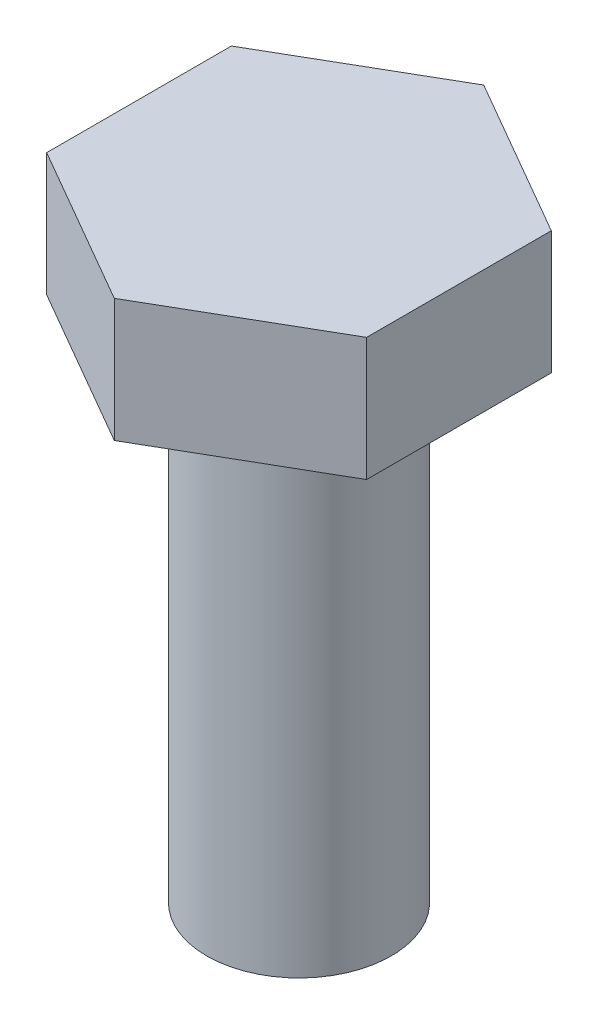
ISO-10303-21;
HEADER;
FILE_DESCRIPTION(('STEP AP214'),'2;1');
FILE_NAME('part.step','',(''),(''),'','','');
FILE_SCHEMA(('AUTOMOTIVE_DESIGN { 1 0 10303 214 1 1 1 1 }'));
ENDSEC;
DATA;
#1=APPLICATION_CONTEXT('core data for automotive mechanical design processes');
#2=APPLICATION_PROTOCOL_DEFINITION('international standard','automotive_design',2000,#1);
#3=PRODUCT_CONTEXT('',#1,'mechanical');
#4=PRODUCT('Part','Part','',(#3));
#5=PRODUCT_RELATED_PRODUCT_CATEGORY('part','',(#4));
#6=PRODUCT_DEFINITION_FORMATION('','',#4);
#7=PRODUCT_DEFINITION_CONTEXT('part definition',#1,'design');
#8=PRODUCT_DEFINITION('design','',#6,#7);
#9=PRODUCT_DEFINITION_SHAPE('','',#8);
#10=(LENGTH_UNIT() NAMED_UNIT(*) SI_UNIT(.MILLI.,.METRE.));
#11=(NAMED_UNIT(*) PLANE_ANGLE_UNIT() SI_UNIT($,.RADIAN.));
#12=(NAMED_UNIT(*) SI_UNIT($,.STERADIAN.) SOLID_ANGLE_UNIT());
#13=UNCERTAINTY_MEASURE_WITH_UNIT(LENGTH_MEASURE(1.E-05),#10,'distance_accuracy_value','');
#14=(GEOMETRIC_REPRESENTATION_CONTEXT(3) GLOBAL_UNCERTAINTY_ASSIGNED_CONTEXT((#13)) GLOBAL_UNIT_ASSIGNED_CONTEXT((#10,
#11,#12)) REPRESENTATION_CONTEXT('',''));
#15=CARTESIAN_POINT('',(0.,0.,0.));
#16=DIRECTION('',(0.,0.,1.));
#17=DIRECTION('',(1.,0.,0.));
#18=AXIS2_PLACEMENT_3D('',#15,#16,#17);
#19=CARTESIAN_POINT('',(0.,40.,0.));
#20=DIRECTION('',(0.,-1.,0.));
#21=DIRECTION('',(0.,0.,-1.));
#22=AXIS2_PLACEMENT_3D('',#19,#20,#21);
#23=CYLINDRICAL_SURFACE('',#22,7.5);
#24=CARTESIAN_POINT('',(0.,40.,0.));
#25=DIRECTION('',(0.,1.,0.));
#26=DIRECTION('',(0.,0.,1.));
#27=AXIS2_PLACEMENT_3D('',#24,#25,#26);
#28=CIRCLE('',#27,7.5);
#29=CARTESIAN_POINT('',(0.,40.,7.5));
#30=VERTEX_POINT('',#29);
#31=EDGE_CURVE('E11',#30,#30,#28,.T.);
#32=ORIENTED_EDGE('',*,*,#31,.F.);
#33=EDGE_LOOP('',(#32));
#34=FACE_BOUND('',#33,.T.);
#35=CARTESIAN_POINT('',(0.,0.,0.));
#36=DIRECTION('',(0.,1.,0.));
#37=DIRECTION('',(0.,0.,1.));
#38=AXIS2_PLACEMENT_3D('',#35,#36,#37);
#39=CIRCLE('',#38,7.5);
#40=CARTESIAN_POINT('',(0.,0.,7.5));
#41=VERTEX_POINT('',#40);
#42=EDGE_CURVE('E34',#41,#41,#39,.T.);
#43=ORIENTED_EDGE('',*,*,#42,.T.);
#44=EDGE_LOOP('',(#43));
#45=FACE_BOUND('',#44,.T.);
#46=ADVANCED_FACE('F31',(#34,#45),#23,.T.);
#47=CARTESIAN_POINT('',(0.,0.,0.));
#48=DIRECTION('',(0.,1.,0.));
#49=DIRECTION('',(0.,0.,1.));
#50=AXIS2_PLACEMENT_3D('',#47,#48,#49);
#51=PLANE('',#50);
#52=ORIENTED_EDGE('',*,*,#42,.F.);
#53=EDGE_LOOP('',(#52));
#54=FACE_BOUND('',#53,.T.);
#55=ADVANCED_FACE('F139',(#54),#51,.F.);
#56=CARTESIAN_POINT('',(12.9903810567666,40.,-7.5));
#57=DIRECTION('',(0.,1.,0.));
#58=DIRECTION('',(0.,0.,1.));
#59=AXIS2_PLACEMENT_3D('',#56,#57,#58);
#60=PLANE('',#59);
#61=DIRECTION('',(0.,0.,-1.));
#62=VECTOR('',#61,1.);
#63=CARTESIAN_POINT('',(12.9903810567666,40.,7.5));
#64=LINE('',#63,#62);
#65=CARTESIAN_POINT('',(12.9903810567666,40.,7.5));
#66=VERTEX_POINT('',#65);
#67=CARTESIAN_POINT('',(12.9903810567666,40.,-7.5));
#68=VERTEX_POINT('',#67);
#69=EDGE_CURVE('E116',#66,#68,#64,.T.);
#70=ORIENTED_EDGE('',*,*,#69,.F.);
#71=DIRECTION('',(0.866025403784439,0.,-0.5));
#72=VECTOR('',#71,1.);
#73=CARTESIAN_POINT('',(0.,40.,15.));
#74=LINE('',#73,#72);
#75=CARTESIAN_POINT('',(0.,40.,15.));
#76=VERTEX_POINT('',#75);
#77=EDGE_CURVE('E76',#76,#66,#74,.T.);
#78=ORIENTED_EDGE('',*,*,#77,.F.);
#79=DIRECTION('',(0.866025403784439,0.,0.5));
#80=VECTOR('',#79,1.);
#81=CARTESIAN_POINT('',(-12.9903810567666,40.,7.5));
#82=LINE('',#81,#80);
#83=CARTESIAN_POINT('',(-12.9903810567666,40.,7.5));
#84=VERTEX_POINT('',#83);
#85=EDGE_CURVE('E70',#84,#76,#82,.T.);
#86=ORIENTED_EDGE('',*,*,#85,.F.);
#87=DIRECTION('',(0.,0.,1.));
#88=VECTOR('',#87,1.);
#89=CARTESIAN_POINT('',(-12.9903810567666,40.,-7.50000000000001));
#90=LINE('',#89,#88);
#91=CARTESIAN_POINT('',(-12.9903810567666,40.,-7.50000000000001));
#92=VERTEX_POINT('',#91);
#93=EDGE_CURVE('E106',#92,#84,#90,.T.);
#94=ORIENTED_EDGE('',*,*,#93,.F.);
#95=DIRECTION('',(-0.866025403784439,0.,0.5));
#96=VECTOR('',#95,1.);
#97=CARTESIAN_POINT('',(0.,40.,-15.));
#98=LINE('',#97,#96);
#99=CARTESIAN_POINT('',(0.,40.,-15.));
#100=VERTEX_POINT('',#99);
#101=EDGE_CURVE('E121',#100,#92,#98,.T.);
#102=ORIENTED_EDGE('',*,*,#101,.F.);
#103=DIRECTION('',(-0.866025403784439,0.,-0.5));
#104=VECTOR('',#103,1.);
#105=CARTESIAN_POINT('',(12.9903810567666,40.,-7.5));
#106=LINE('',#105,#104);
#107=EDGE_CURVE('E119',#68,#100,#106,.T.);
#108=ORIENTED_EDGE('',*,*,#107,.F.);
#109=EDGE_LOOP('',(#70,#78,#86,#94,#102,#108));
#110=FACE_BOUND('',#109,.T.);
#111=ORIENTED_EDGE('',*,*,#31,.T.);
#112=EDGE_LOOP('',(#111));
#113=FACE_BOUND('',#112,.T.);
#114=ADVANCED_FACE('F141',(#110,#113),#60,.F.);
#115=CARTESIAN_POINT('',(12.9903810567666,50.,7.5));
#116=DIRECTION('',(-1.,0.,0.));
#117=DIRECTION('',(0.,0.,1.));
#118=AXIS2_PLACEMENT_3D('',#115,#116,#117);
#119=PLANE('',#118);
#120=ORIENTED_EDGE('',*,*,#69,.T.);
#121=DIRECTION('',(0.,-1.,0.));
#122=VECTOR('',#121,1.);
#123=CARTESIAN_POINT('',(12.9903810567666,50.,-7.5));
#124=LINE('',#123,#122);
#125=CARTESIAN_POINT('',(12.9903810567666,50.,-7.5));
#126=VERTEX_POINT('',#125);
#127=EDGE_CURVE('E133',#126,#68,#124,.T.);
#128=ORIENTED_EDGE('',*,*,#127,.F.);
#129=DIRECTION('',(0.,0.,-1.));
#130=VECTOR('',#129,1.);
#131=CARTESIAN_POINT('',(12.9903810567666,50.,7.5));
#132=LINE('',#131,#130);
#133=CARTESIAN_POINT('',(12.9903810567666,50.,7.5));
#134=VERTEX_POINT('',#133);
#135=EDGE_CURVE('E126',#134,#126,#132,.T.);
#136=ORIENTED_EDGE('',*,*,#135,.F.);
#137=DIRECTION('',(0.,-1.,0.));
#138=VECTOR('',#137,1.);
#139=CARTESIAN_POINT('',(12.9903810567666,50.,7.5));
#140=LINE('',#139,#138);
#141=EDGE_CURVE('E112',#134,#66,#140,.T.);
#142=ORIENTED_EDGE('',*,*,#141,.T.);
#143=EDGE_LOOP('',(#120,#128,#136,#142));
#144=FACE_BOUND('',#143,.T.);
#145=ADVANCED_FACE('F146',(#144),#119,.F.);
#146=CARTESIAN_POINT('',(12.9903810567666,50.,-7.5));
#147=DIRECTION('',(-0.5,0.,0.866025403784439));
#148=DIRECTION('',(0.866025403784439,0.,0.5));
#149=AXIS2_PLACEMENT_3D('',#146,#147,#148);
#150=PLANE('',#149);
#151=ORIENTED_EDGE('',*,*,#107,.T.);
#152=DIRECTION('',(0.,-1.,0.));
#153=VECTOR('',#152,1.);
#154=CARTESIAN_POINT('',(0.,50.,-15.));
#155=LINE('',#154,#153);
#156=CARTESIAN_POINT('',(0.,50.,-15.));
#157=VERTEX_POINT('',#156);
#158=EDGE_CURVE('E130',#157,#100,#155,.T.);
#159=ORIENTED_EDGE('',*,*,#158,.F.);
#160=DIRECTION('',(-0.866025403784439,0.,-0.5));
#161=VECTOR('',#160,1.);
#162=CARTESIAN_POINT('',(12.9903810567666,50.,-7.5));
#163=LINE('',#162,#161);
#164=EDGE_CURVE('E85',#126,#157,#163,.T.);
#165=ORIENTED_EDGE('',*,*,#164,.F.);
#166=ORIENTED_EDGE('',*,*,#127,.T.);
#167=EDGE_LOOP('',(#151,#159,#165,#166));
#168=FACE_BOUND('',#167,.T.);
#169=ADVANCED_FACE('F153',(#168),#150,.F.);
#170=CARTESIAN_POINT('',(0.,50.,-15.));
#171=DIRECTION('',(0.5,0.,0.866025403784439));
#172=DIRECTION('',(0.866025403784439,0.,-0.5));
#173=AXIS2_PLACEMENT_3D('',#170,#171,#172);
#174=PLANE('',#173);
#175=ORIENTED_EDGE('',*,*,#101,.T.);
#176=DIRECTION('',(0.,-1.,0.));
#177=VECTOR('',#176,1.);
#178=CARTESIAN_POINT('',(-12.9903810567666,50.,-7.50000000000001));
#179=LINE('',#178,#177);
#180=CARTESIAN_POINT('',(-12.9903810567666,50.,-7.50000000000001));
#181=VERTEX_POINT('',#180);
#182=EDGE_CURVE('E107',#181,#92,#179,.T.);
#183=ORIENTED_EDGE('',*,*,#182,.F.);
#184=DIRECTION('',(-0.866025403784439,0.,0.5));
#185=VECTOR('',#184,1.);
#186=CARTESIAN_POINT('',(0.,50.,-15.));
#187=LINE('',#186,#185);
#188=EDGE_CURVE('E98',#157,#181,#187,.T.);
#189=ORIENTED_EDGE('',*,*,#188,.F.);
#190=ORIENTED_EDGE('',*,*,#158,.T.);
#191=EDGE_LOOP('',(#175,#183,#189,#190));
#192=FACE_BOUND('',#191,.T.);
#193=ADVANCED_FACE('F157',(#192),#174,.F.);
#194=CARTESIAN_POINT('',(-12.9903810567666,50.,-7.50000000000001));
#195=DIRECTION('',(1.,0.,0.));
#196=DIRECTION('',(0.,0.,-1.));
#197=AXIS2_PLACEMENT_3D('',#194,#195,#196);
#198=PLANE('',#197);
#199=ORIENTED_EDGE('',*,*,#93,.T.);
#200=DIRECTION('',(0.,-1.,0.));
#201=VECTOR('',#200,1.);
#202=CARTESIAN_POINT('',(-12.9903810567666,50.,7.5));
#203=LINE('',#202,#201);
#204=CARTESIAN_POINT('',(-12.9903810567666,50.,7.5));
#205=VERTEX_POINT('',#204);
#206=EDGE_CURVE('E103',#205,#84,#203,.T.);
#207=ORIENTED_EDGE('',*,*,#206,.F.);
#208=DIRECTION('',(0.,0.,1.));
#209=VECTOR('',#208,1.);
#210=CARTESIAN_POINT('',(-12.9903810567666,50.,-7.50000000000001));
#211=LINE('',#210,#209);
#212=EDGE_CURVE('E92',#181,#205,#211,.T.);
#213=ORIENTED_EDGE('',*,*,#212,.F.);
#214=ORIENTED_EDGE('',*,*,#182,.T.);
#215=EDGE_LOOP('',(#199,#207,#213,#214));
#216=FACE_BOUND('',#215,.T.);
#217=ADVANCED_FACE('F104',(#216),#198,.F.);
#218=CARTESIAN_POINT('',(-12.9903810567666,50.,7.5));
#219=DIRECTION('',(0.5,0.,-0.866025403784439));
#220=DIRECTION('',(-0.866025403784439,0.,-0.5));
#221=AXIS2_PLACEMENT_3D('',#218,#219,#220);
#222=PLANE('',#221);
#223=ORIENTED_EDGE('',*,*,#85,.T.);
#224=DIRECTION('',(0.,-1.,0.));
#225=VECTOR('',#224,1.);
#226=CARTESIAN_POINT('',(0.,50.,15.));
#227=LINE('',#226,#225);
#228=CARTESIAN_POINT('',(0.,50.,15.));
#229=VERTEX_POINT('',#228);
#230=EDGE_CURVE('E108',#229,#76,#227,.T.);
#231=ORIENTED_EDGE('',*,*,#230,.F.);
#232=DIRECTION('',(0.866025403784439,0.,0.5));
#233=VECTOR('',#232,1.);
#234=CARTESIAN_POINT('',(-12.9903810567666,50.,7.5));
#235=LINE('',#234,#233);
#236=EDGE_CURVE('E96',#205,#229,#235,.T.);
#237=ORIENTED_EDGE('',*,*,#236,.F.);
#238=ORIENTED_EDGE('',*,*,#206,.T.);
#239=EDGE_LOOP('',(#223,#231,#237,#238));
#240=FACE_BOUND('',#239,.T.);
#241=ADVANCED_FACE('F110',(#240),#222,.F.);
#242=CARTESIAN_POINT('',(0.,50.,15.));
#243=DIRECTION('',(-0.5,0.,-0.866025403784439));
#244=DIRECTION('',(-0.866025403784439,0.,0.5));
#245=AXIS2_PLACEMENT_3D('',#242,#243,#244);
#246=PLANE('',#245);
#247=ORIENTED_EDGE('',*,*,#77,.T.);
#248=ORIENTED_EDGE('',*,*,#141,.F.);
#249=DIRECTION('',(0.866025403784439,0.,-0.5));
#250=VECTOR('',#249,1.);
#251=CARTESIAN_POINT('',(0.,50.,15.));
#252=LINE('',#251,#250);
#253=EDGE_CURVE('E47',#229,#134,#252,.T.);
#254=ORIENTED_EDGE('',*,*,#253,.F.);
#255=ORIENTED_EDGE('',*,*,#230,.T.);
#256=EDGE_LOOP('',(#247,#248,#254,#255));
#257=FACE_BOUND('',#256,.T.);
#258=ADVANCED_FACE('F165',(#257),#246,.F.);
#259=CARTESIAN_POINT('',(12.9903810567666,50.,-7.5));
#260=DIRECTION('',(0.,1.,0.));
#261=DIRECTION('',(0.,0.,1.));
#262=AXIS2_PLACEMENT_3D('',#259,#260,#261);
#263=PLANE('',#262);
#264=ORIENTED_EDGE('',*,*,#135,.T.);
#265=ORIENTED_EDGE('',*,*,#164,.T.);
#266=ORIENTED_EDGE('',*,*,#188,.T.);
#267=ORIENTED_EDGE('',*,*,#212,.T.);
#268=ORIENTED_EDGE('',*,*,#236,.T.);
#269=ORIENTED_EDGE('',*,*,#253,.T.);
#270=EDGE_LOOP('',(#264,#265,#266,#267,#268,#269));
#271=FACE_BOUND('',#270,.T.);
#272=ADVANCED_FACE('F94',(#271),#263,.T.);
#273=CLOSED_SHELL('',(#46,#55,#114,#145,#169,#193,#217,#241,#258,#272));
#274=MANIFOLD_SOLID_BREP('B2',#273);
#275=ADVANCED_BREP_SHAPE_REPRESENTATION('',(#18,#274),#14);
#276=SHAPE_DEFINITION_REPRESENTATION(#9,#275);
ENDSEC;
END-ISO-10303-21;
